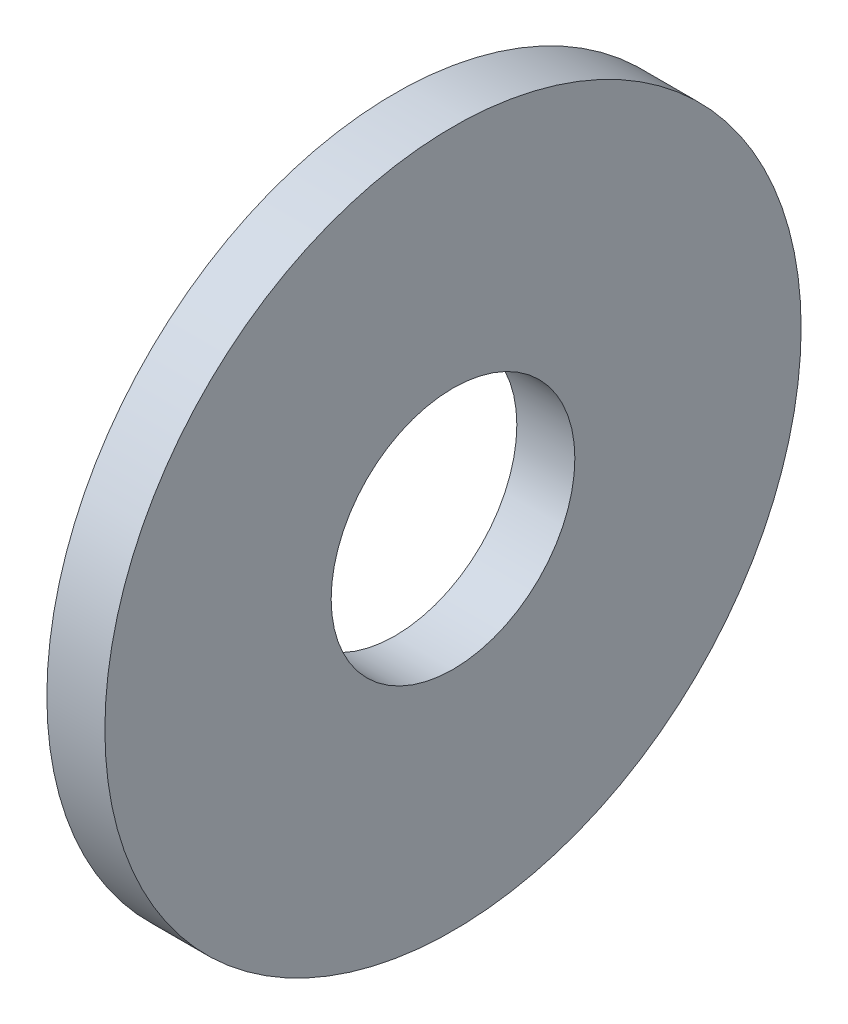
from build123d import *

# Parameters (mm, degrees)
ESQUISSE2_W = 2
ESQUISSE2_H = 7.8


with BuildPart() as part:
    # Esquisse2 → R_volution1 (revolve)
    with BuildSketch(Plane.XY, mode=Mode.PRIVATE) as r_volution1_sk:
        with Locations((1, 8.1)):
            Rectangle(ESQUISSE2_W, ESQUISSE2_H)
    revolve(r_volution1_sk.sketch.rotate(Axis((-7.455836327, 0, 0), (1, 0, 0)), 90), axis=Axis((-7.455836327, 0, 0), (1, 0, 0)))


solid = part.part
